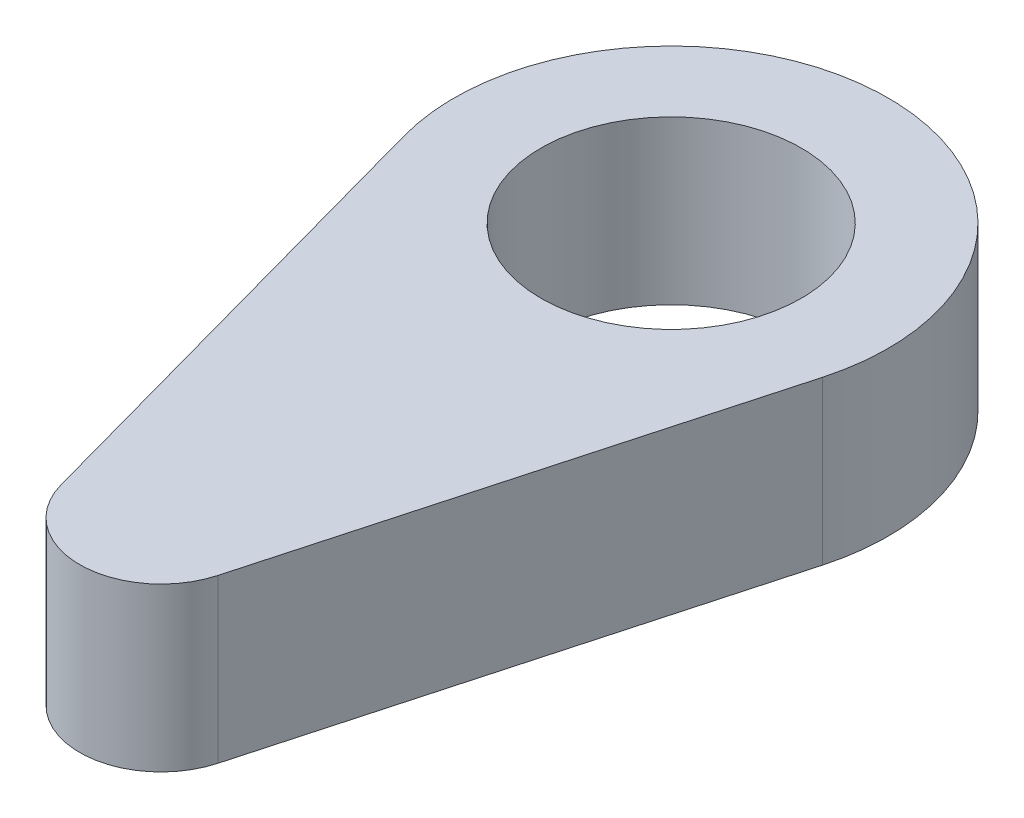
ISO-10303-21;
HEADER;
FILE_DESCRIPTION(('STEP AP214'),'2;1');
FILE_NAME('part.step','',(''),(''),'','','');
FILE_SCHEMA(('AUTOMOTIVE_DESIGN { 1 0 10303 214 1 1 1 1 }'));
ENDSEC;
DATA;
#1=APPLICATION_CONTEXT('core data for automotive mechanical design processes');
#2=APPLICATION_PROTOCOL_DEFINITION('international standard','automotive_design',2000,#1);
#3=PRODUCT_CONTEXT('',#1,'mechanical');
#4=PRODUCT('Part','Part','',(#3));
#5=PRODUCT_RELATED_PRODUCT_CATEGORY('part','',(#4));
#6=PRODUCT_DEFINITION_FORMATION('','',#4);
#7=PRODUCT_DEFINITION_CONTEXT('part definition',#1,'design');
#8=PRODUCT_DEFINITION('design','',#6,#7);
#9=PRODUCT_DEFINITION_SHAPE('','',#8);
#10=(LENGTH_UNIT() NAMED_UNIT(*) SI_UNIT(.MILLI.,.METRE.));
#11=(NAMED_UNIT(*) PLANE_ANGLE_UNIT() SI_UNIT($,.RADIAN.));
#12=(NAMED_UNIT(*) SI_UNIT($,.STERADIAN.) SOLID_ANGLE_UNIT());
#13=UNCERTAINTY_MEASURE_WITH_UNIT(LENGTH_MEASURE(1.E-05),#10,'distance_accuracy_value','');
#14=(GEOMETRIC_REPRESENTATION_CONTEXT(3) GLOBAL_UNCERTAINTY_ASSIGNED_CONTEXT((#13)) GLOBAL_UNIT_ASSIGNED_CONTEXT((#10,
#11,#12)) REPRESENTATION_CONTEXT('',''));
#15=CARTESIAN_POINT('',(0.,0.,0.));
#16=DIRECTION('',(0.,0.,1.));
#17=DIRECTION('',(1.,0.,0.));
#18=AXIS2_PLACEMENT_3D('',#15,#16,#17);
#19=CARTESIAN_POINT('',(0.,3.,0.));
#20=DIRECTION('',(0.,1.,0.));
#21=DIRECTION('',(0.,0.,1.));
#22=AXIS2_PLACEMENT_3D('',#19,#20,#21);
#23=PLANE('',#22);
#24=CARTESIAN_POINT('',(0.,3.,0.));
#25=DIRECTION('',(0.,1.,0.));
#26=DIRECTION('',(0.,0.,1.));
#27=AXIS2_PLACEMENT_3D('',#24,#25,#26);
#28=CIRCLE('',#27,4.);
#29=CARTESIAN_POINT('',(3.85606427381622,3.,1.06337590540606));
#30=VERTEX_POINT('',#29);
#31=CARTESIAN_POINT('',(-3.85606427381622,3.,1.06337590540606));
#32=VERTEX_POINT('',#31);
#33=EDGE_CURVE('E93',#30,#32,#28,.T.);
#34=ORIENTED_EDGE('',*,*,#33,.T.);
#35=DIRECTION('',(0.265843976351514,0.,0.964016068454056));
#36=VECTOR('',#35,1.);
#37=CARTESIAN_POINT('',(-3.85606427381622,3.,1.06337590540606));
#38=LINE('',#37,#36);
#39=CARTESIAN_POINT('',(-1.44602410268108,3.,9.80277817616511));
#40=VERTEX_POINT('',#39);
#41=EDGE_CURVE('E88',#32,#40,#38,.T.);
#42=ORIENTED_EDGE('',*,*,#41,.T.);
#43=CARTESIAN_POINT('',(0.,3.,9.40401221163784));
#44=DIRECTION('',(0.,1.,0.));
#45=DIRECTION('',(0.,0.,1.));
#46=AXIS2_PLACEMENT_3D('',#43,#44,#45);
#47=CIRCLE('',#46,1.5);
#48=CARTESIAN_POINT('',(1.44602410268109,3.,9.80277817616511));
#49=VERTEX_POINT('',#48);
#50=EDGE_CURVE('E91',#40,#49,#47,.T.);
#51=ORIENTED_EDGE('',*,*,#50,.T.);
#52=DIRECTION('',(0.265843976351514,0.,-0.964016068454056));
#53=VECTOR('',#52,1.);
#54=CARTESIAN_POINT('',(3.85606427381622,3.,1.06337590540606));
#55=LINE('',#54,#53);
#56=EDGE_CURVE('E58',#49,#30,#55,.T.);
#57=ORIENTED_EDGE('',*,*,#56,.T.);
#58=EDGE_LOOP('',(#34,#42,#51,#57));
#59=FACE_BOUND('',#58,.T.);
#60=CARTESIAN_POINT('',(0.,3.,0.));
#61=DIRECTION('',(0.,1.,0.));
#62=DIRECTION('',(0.,0.,1.));
#63=AXIS2_PLACEMENT_3D('',#60,#61,#62);
#64=CIRCLE('',#63,2.4003);
#65=CARTESIAN_POINT('',(0.,3.,2.4003));
#66=VERTEX_POINT('',#65);
#67=EDGE_CURVE('E108',#66,#66,#64,.T.);
#68=ORIENTED_EDGE('',*,*,#67,.F.);
#69=EDGE_LOOP('',(#68));
#70=FACE_BOUND('',#69,.T.);
#71=ADVANCED_FACE('F41',(#59,#70),#23,.T.);
#72=CARTESIAN_POINT('',(0.,0.,0.));
#73=DIRECTION('',(0.,1.,0.));
#74=DIRECTION('',(0.,0.,1.));
#75=AXIS2_PLACEMENT_3D('',#72,#73,#74);
#76=PLANE('',#75);
#77=CARTESIAN_POINT('',(0.,0.,0.));
#78=DIRECTION('',(0.,1.,0.));
#79=DIRECTION('',(0.,0.,1.));
#80=AXIS2_PLACEMENT_3D('',#77,#78,#79);
#81=CIRCLE('',#80,4.);
#82=CARTESIAN_POINT('',(3.85606427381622,0.,1.06337590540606));
#83=VERTEX_POINT('',#82);
#84=CARTESIAN_POINT('',(-3.85606427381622,0.,1.06337590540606));
#85=VERTEX_POINT('',#84);
#86=EDGE_CURVE('E105',#83,#85,#81,.T.);
#87=ORIENTED_EDGE('',*,*,#86,.F.);
#88=DIRECTION('',(0.265843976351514,0.,-0.964016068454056));
#89=VECTOR('',#88,1.);
#90=CARTESIAN_POINT('',(3.85606427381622,0.,1.06337590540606));
#91=LINE('',#90,#89);
#92=CARTESIAN_POINT('',(1.44602410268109,0.,9.80277817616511));
#93=VERTEX_POINT('',#92);
#94=EDGE_CURVE('E81',#93,#83,#91,.T.);
#95=ORIENTED_EDGE('',*,*,#94,.F.);
#96=CARTESIAN_POINT('',(0.,0.,9.40401221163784));
#97=DIRECTION('',(0.,1.,0.));
#98=DIRECTION('',(0.,0.,1.));
#99=AXIS2_PLACEMENT_3D('',#96,#97,#98);
#100=CIRCLE('',#99,1.5);
#101=CARTESIAN_POINT('',(-1.44602410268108,0.,9.80277817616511));
#102=VERTEX_POINT('',#101);
#103=EDGE_CURVE('E75',#102,#93,#100,.T.);
#104=ORIENTED_EDGE('',*,*,#103,.F.);
#105=DIRECTION('',(0.265843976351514,0.,0.964016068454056));
#106=VECTOR('',#105,1.);
#107=CARTESIAN_POINT('',(-3.85606427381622,0.,1.06337590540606));
#108=LINE('',#107,#106);
#109=EDGE_CURVE('E97',#85,#102,#108,.T.);
#110=ORIENTED_EDGE('',*,*,#109,.F.);
#111=EDGE_LOOP('',(#87,#95,#104,#110));
#112=FACE_BOUND('',#111,.T.);
#113=CARTESIAN_POINT('',(0.,0.,0.));
#114=DIRECTION('',(0.,1.,0.));
#115=DIRECTION('',(0.,0.,1.));
#116=AXIS2_PLACEMENT_3D('',#113,#114,#115);
#117=CIRCLE('',#116,2.4003);
#118=CARTESIAN_POINT('',(0.,0.,2.4003));
#119=VERTEX_POINT('',#118);
#120=EDGE_CURVE('E120',#119,#119,#117,.T.);
#121=ORIENTED_EDGE('',*,*,#120,.T.);
#122=EDGE_LOOP('',(#121));
#123=FACE_BOUND('',#122,.T.);
#124=ADVANCED_FACE('F116',(#112,#123),#76,.F.);
#125=CARTESIAN_POINT('',(0.,3.,0.));
#126=DIRECTION('',(0.,-1.,0.));
#127=DIRECTION('',(0.,0.,-1.));
#128=AXIS2_PLACEMENT_3D('',#125,#126,#127);
#129=CYLINDRICAL_SURFACE('',#128,4.);
#130=ORIENTED_EDGE('',*,*,#86,.T.);
#131=DIRECTION('',(0.,-1.,0.));
#132=VECTOR('',#131,1.);
#133=CARTESIAN_POINT('',(-3.85606427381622,3.,1.06337590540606));
#134=LINE('',#133,#132);
#135=EDGE_CURVE('E11',#32,#85,#134,.T.);
#136=ORIENTED_EDGE('',*,*,#135,.F.);
#137=ORIENTED_EDGE('',*,*,#33,.F.);
#138=DIRECTION('',(0.,-1.,0.));
#139=VECTOR('',#138,1.);
#140=CARTESIAN_POINT('',(3.85606427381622,3.,1.06337590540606));
#141=LINE('',#140,#139);
#142=EDGE_CURVE('E101',#30,#83,#141,.T.);
#143=ORIENTED_EDGE('',*,*,#142,.T.);
#144=EDGE_LOOP('',(#130,#136,#137,#143));
#145=FACE_BOUND('',#144,.T.);
#146=ADVANCED_FACE('F43',(#145),#129,.T.);
#147=CARTESIAN_POINT('',(-3.85606427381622,3.,1.06337590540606));
#148=DIRECTION('',(0.964016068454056,0.,-0.265843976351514));
#149=DIRECTION('',(-0.265843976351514,0.,-0.964016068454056));
#150=AXIS2_PLACEMENT_3D('',#147,#148,#149);
#151=PLANE('',#150);
#152=ORIENTED_EDGE('',*,*,#109,.T.);
#153=DIRECTION('',(0.,-1.,0.));
#154=VECTOR('',#153,1.);
#155=CARTESIAN_POINT('',(-1.44602410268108,3.,9.80277817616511));
#156=LINE('',#155,#154);
#157=EDGE_CURVE('E50',#40,#102,#156,.T.);
#158=ORIENTED_EDGE('',*,*,#157,.F.);
#159=ORIENTED_EDGE('',*,*,#41,.F.);
#160=ORIENTED_EDGE('',*,*,#135,.T.);
#161=EDGE_LOOP('',(#152,#158,#159,#160));
#162=FACE_BOUND('',#161,.T.);
#163=ADVANCED_FACE('F96',(#162),#151,.F.);
#164=CARTESIAN_POINT('',(0.,3.,9.40401221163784));
#165=DIRECTION('',(0.,-1.,0.));
#166=DIRECTION('',(0.,0.,-1.));
#167=AXIS2_PLACEMENT_3D('',#164,#165,#166);
#168=CYLINDRICAL_SURFACE('',#167,1.5);
#169=ORIENTED_EDGE('',*,*,#103,.T.);
#170=DIRECTION('',(0.,-1.,0.));
#171=VECTOR('',#170,1.);
#172=CARTESIAN_POINT('',(1.44602410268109,3.,9.80277817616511));
#173=LINE('',#172,#171);
#174=EDGE_CURVE('E98',#49,#93,#173,.T.);
#175=ORIENTED_EDGE('',*,*,#174,.F.);
#176=ORIENTED_EDGE('',*,*,#50,.F.);
#177=ORIENTED_EDGE('',*,*,#157,.T.);
#178=EDGE_LOOP('',(#169,#175,#176,#177));
#179=FACE_BOUND('',#178,.T.);
#180=ADVANCED_FACE('F99',(#179),#168,.T.);
#181=CARTESIAN_POINT('',(3.85606427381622,3.,1.06337590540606));
#182=DIRECTION('',(-0.964016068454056,0.,-0.265843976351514));
#183=DIRECTION('',(-0.265843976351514,0.,0.964016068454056));
#184=AXIS2_PLACEMENT_3D('',#181,#182,#183);
#185=PLANE('',#184);
#186=ORIENTED_EDGE('',*,*,#94,.T.);
#187=ORIENTED_EDGE('',*,*,#142,.F.);
#188=ORIENTED_EDGE('',*,*,#56,.F.);
#189=ORIENTED_EDGE('',*,*,#174,.T.);
#190=EDGE_LOOP('',(#186,#187,#188,#189));
#191=FACE_BOUND('',#190,.T.);
#192=ADVANCED_FACE('F113',(#191),#185,.F.);
#193=CARTESIAN_POINT('',(0.,3.,0.));
#194=DIRECTION('',(0.,-1.,0.));
#195=DIRECTION('',(0.,0.,-1.));
#196=AXIS2_PLACEMENT_3D('',#193,#194,#195);
#197=CYLINDRICAL_SURFACE('',#196,2.4003);
#198=ORIENTED_EDGE('',*,*,#67,.T.);
#199=EDGE_LOOP('',(#198));
#200=FACE_BOUND('',#199,.T.);
#201=ORIENTED_EDGE('',*,*,#120,.F.);
#202=EDGE_LOOP('',(#201));
#203=FACE_BOUND('',#202,.T.);
#204=ADVANCED_FACE('F126',(#200,#203),#197,.F.);
#205=CLOSED_SHELL('',(#71,#124,#146,#163,#180,#192,#204));
#206=MANIFOLD_SOLID_BREP('B2',#205);
#207=ADVANCED_BREP_SHAPE_REPRESENTATION('',(#18,#206),#14);
#208=SHAPE_DEFINITION_REPRESENTATION(#9,#207);
ENDSEC;
END-ISO-10303-21;
